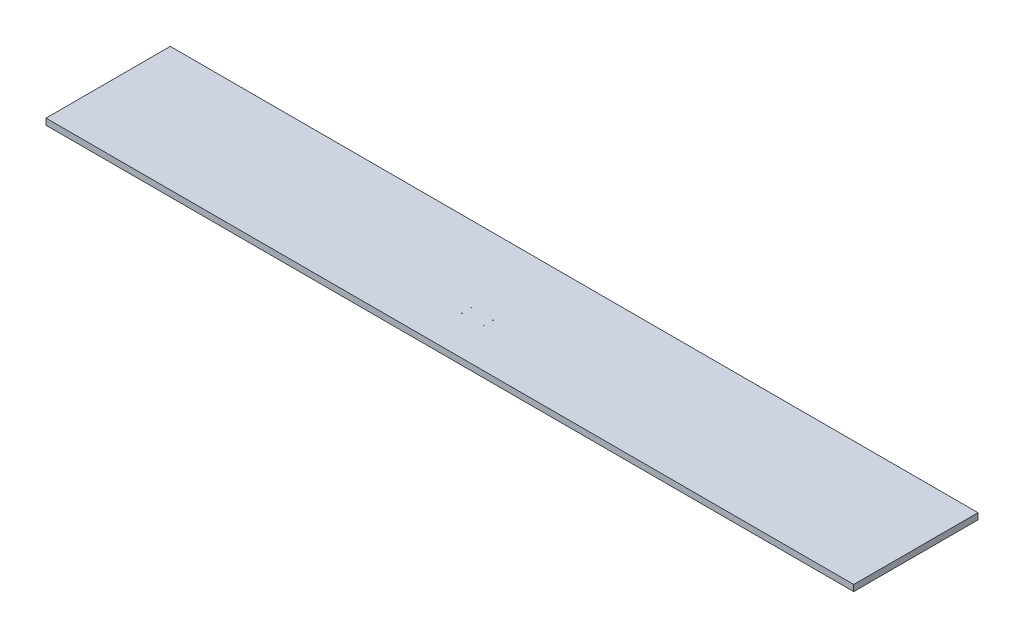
ISO-10303-21;
HEADER;
FILE_DESCRIPTION(('STEP AP214'),'2;1');
FILE_NAME('part.step','',(''),(''),'','','');
FILE_SCHEMA(('AUTOMOTIVE_DESIGN { 1 0 10303 214 1 1 1 1 }'));
ENDSEC;
DATA;
#1=APPLICATION_CONTEXT('core data for automotive mechanical design processes');
#2=APPLICATION_PROTOCOL_DEFINITION('international standard','automotive_design',2000,#1);
#3=PRODUCT_CONTEXT('',#1,'mechanical');
#4=PRODUCT('Part','Part','',(#3));
#5=PRODUCT_RELATED_PRODUCT_CATEGORY('part','',(#4));
#6=PRODUCT_DEFINITION_FORMATION('','',#4);
#7=PRODUCT_DEFINITION_CONTEXT('part definition',#1,'design');
#8=PRODUCT_DEFINITION('design','',#6,#7);
#9=PRODUCT_DEFINITION_SHAPE('','',#8);
#10=(LENGTH_UNIT() NAMED_UNIT(*) SI_UNIT(.MILLI.,.METRE.));
#11=(NAMED_UNIT(*) PLANE_ANGLE_UNIT() SI_UNIT($,.RADIAN.));
#12=(NAMED_UNIT(*) SI_UNIT($,.STERADIAN.) SOLID_ANGLE_UNIT());
#13=UNCERTAINTY_MEASURE_WITH_UNIT(LENGTH_MEASURE(1.E-05),#10,'distance_accuracy_value','');
#14=(GEOMETRIC_REPRESENTATION_CONTEXT(3) GLOBAL_UNCERTAINTY_ASSIGNED_CONTEXT((#13)) GLOBAL_UNIT_ASSIGNED_CONTEXT((#10,
#11,#12)) REPRESENTATION_CONTEXT('',''));
#15=CARTESIAN_POINT('',(0.,0.,0.));
#16=DIRECTION('',(0.,0.,1.));
#17=DIRECTION('',(1.,0.,0.));
#18=AXIS2_PLACEMENT_3D('',#15,#16,#17);
#19=CARTESIAN_POINT('',(6500.,-100.,-1000.));
#20=DIRECTION('',(1.,0.,0.));
#21=DIRECTION('',(0.,0.,-1.));
#22=AXIS2_PLACEMENT_3D('',#19,#20,#21);
#23=PLANE('',#22);
#24=DIRECTION('',(0.,0.,-1.));
#25=VECTOR('',#24,1.);
#26=CARTESIAN_POINT('',(6500.,0.,-1000.));
#27=LINE('',#26,#25);
#28=CARTESIAN_POINT('',(6500.,0.,1000.));
#29=VERTEX_POINT('',#28);
#30=CARTESIAN_POINT('',(6500.,0.,-1000.));
#31=VERTEX_POINT('',#30);
#32=EDGE_CURVE('E100',#29,#31,#27,.T.);
#33=ORIENTED_EDGE('',*,*,#32,.F.);
#34=DIRECTION('',(0.,1.,0.));
#35=VECTOR('',#34,1.);
#36=CARTESIAN_POINT('',(6500.,-100.,1000.));
#37=LINE('',#36,#35);
#38=CARTESIAN_POINT('',(6500.,-100.,1000.));
#39=VERTEX_POINT('',#38);
#40=EDGE_CURVE('E11',#39,#29,#37,.T.);
#41=ORIENTED_EDGE('',*,*,#40,.F.);
#42=DIRECTION('',(0.,0.,-1.));
#43=VECTOR('',#42,1.);
#44=CARTESIAN_POINT('',(6500.,-100.,-1000.));
#45=LINE('',#44,#43);
#46=CARTESIAN_POINT('',(6500.,-100.,-1000.));
#47=VERTEX_POINT('',#46);
#48=EDGE_CURVE('E93',#39,#47,#45,.T.);
#49=ORIENTED_EDGE('',*,*,#48,.T.);
#50=DIRECTION('',(0.,1.,0.));
#51=VECTOR('',#50,1.);
#52=CARTESIAN_POINT('',(6500.,-100.,-1000.));
#53=LINE('',#52,#51);
#54=EDGE_CURVE('E38',#47,#31,#53,.T.);
#55=ORIENTED_EDGE('',*,*,#54,.T.);
#56=EDGE_LOOP('',(#33,#41,#49,#55));
#57=FACE_BOUND('',#56,.T.);
#58=ADVANCED_FACE('F35',(#57),#23,.T.);
#59=CARTESIAN_POINT('',(-6500.,-100.,1000.));
#60=DIRECTION('',(0.,0.,1.));
#61=DIRECTION('',(1.,0.,0.));
#62=AXIS2_PLACEMENT_3D('',#59,#60,#61);
#63=PLANE('',#62);
#64=DIRECTION('',(1.,0.,0.));
#65=VECTOR('',#64,1.);
#66=CARTESIAN_POINT('',(-6500.,0.,1000.));
#67=LINE('',#66,#65);
#68=CARTESIAN_POINT('',(-6500.,0.,1000.));
#69=VERTEX_POINT('',#68);
#70=EDGE_CURVE('E95',#69,#29,#67,.T.);
#71=ORIENTED_EDGE('',*,*,#70,.F.);
#72=DIRECTION('',(0.,1.,0.));
#73=VECTOR('',#72,1.);
#74=CARTESIAN_POINT('',(-6500.,-100.,1000.));
#75=LINE('',#74,#73);
#76=CARTESIAN_POINT('',(-6500.,-100.,1000.));
#77=VERTEX_POINT('',#76);
#78=EDGE_CURVE('E44',#77,#69,#75,.T.);
#79=ORIENTED_EDGE('',*,*,#78,.F.);
#80=DIRECTION('',(1.,0.,0.));
#81=VECTOR('',#80,1.);
#82=CARTESIAN_POINT('',(-6500.,-100.,1000.));
#83=LINE('',#82,#81);
#84=EDGE_CURVE('E90',#77,#39,#83,.T.);
#85=ORIENTED_EDGE('',*,*,#84,.T.);
#86=ORIENTED_EDGE('',*,*,#40,.T.);
#87=EDGE_LOOP('',(#71,#79,#85,#86));
#88=FACE_BOUND('',#87,.T.);
#89=ADVANCED_FACE('F111',(#88),#63,.T.);
#90=CARTESIAN_POINT('',(-6500.,-100.,-1000.));
#91=DIRECTION('',(-1.,0.,0.));
#92=DIRECTION('',(0.,0.,1.));
#93=AXIS2_PLACEMENT_3D('',#90,#91,#92);
#94=PLANE('',#93);
#95=DIRECTION('',(0.,0.,1.));
#96=VECTOR('',#95,1.);
#97=CARTESIAN_POINT('',(-6500.,0.,-1000.));
#98=LINE('',#97,#96);
#99=CARTESIAN_POINT('',(-6500.,0.,-1000.));
#100=VERTEX_POINT('',#99);
#101=EDGE_CURVE('E85',#100,#69,#98,.T.);
#102=ORIENTED_EDGE('',*,*,#101,.F.);
#103=DIRECTION('',(0.,1.,0.));
#104=VECTOR('',#103,1.);
#105=CARTESIAN_POINT('',(-6500.,-100.,-1000.));
#106=LINE('',#105,#104);
#107=CARTESIAN_POINT('',(-6500.,-100.,-1000.));
#108=VERTEX_POINT('',#107);
#109=EDGE_CURVE('E80',#108,#100,#106,.T.);
#110=ORIENTED_EDGE('',*,*,#109,.F.);
#111=DIRECTION('',(0.,0.,1.));
#112=VECTOR('',#111,1.);
#113=CARTESIAN_POINT('',(-6500.,-100.,-1000.));
#114=LINE('',#113,#112);
#115=EDGE_CURVE('E83',#108,#77,#114,.T.);
#116=ORIENTED_EDGE('',*,*,#115,.T.);
#117=ORIENTED_EDGE('',*,*,#78,.T.);
#118=EDGE_LOOP('',(#102,#110,#116,#117));
#119=FACE_BOUND('',#118,.T.);
#120=ADVANCED_FACE('F82',(#119),#94,.T.);
#121=CARTESIAN_POINT('',(-6500.,-100.,-1000.));
#122=DIRECTION('',(0.,0.,-1.));
#123=DIRECTION('',(-1.,0.,0.));
#124=AXIS2_PLACEMENT_3D('',#121,#122,#123);
#125=PLANE('',#124);
#126=DIRECTION('',(-1.,0.,0.));
#127=VECTOR('',#126,1.);
#128=CARTESIAN_POINT('',(-6500.,0.,-1000.));
#129=LINE('',#128,#127);
#130=EDGE_CURVE('E103',#31,#100,#129,.T.);
#131=ORIENTED_EDGE('',*,*,#130,.F.);
#132=ORIENTED_EDGE('',*,*,#54,.F.);
#133=DIRECTION('',(-1.,0.,0.));
#134=VECTOR('',#133,1.);
#135=CARTESIAN_POINT('',(-6500.,-100.,-1000.));
#136=LINE('',#135,#134);
#137=EDGE_CURVE('E89',#47,#108,#136,.T.);
#138=ORIENTED_EDGE('',*,*,#137,.T.);
#139=ORIENTED_EDGE('',*,*,#109,.T.);
#140=EDGE_LOOP('',(#131,#132,#138,#139));
#141=FACE_BOUND('',#140,.T.);
#142=ADVANCED_FACE('F92',(#141),#125,.T.);
#143=CARTESIAN_POINT('',(0.,-100.,0.));
#144=DIRECTION('',(0.,1.,0.));
#145=DIRECTION('',(0.,0.,1.));
#146=AXIS2_PLACEMENT_3D('',#143,#144,#145);
#147=PLANE('',#146);
#148=CARTESIAN_POINT('',(-85.0000000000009,-100.,370.));
#149=DIRECTION('',(0.,1.,0.));
#150=DIRECTION('',(0.,0.,1.));
#151=AXIS2_PLACEMENT_3D('',#148,#149,#150);
#152=CIRCLE('',#151,5.00000000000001);
#153=CARTESIAN_POINT('',(-85.0000000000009,-100.,375.));
#154=VERTEX_POINT('',#153);
#155=EDGE_CURVE('E162',#154,#154,#152,.T.);
#156=ORIENTED_EDGE('',*,*,#155,.T.);
#157=EDGE_LOOP('',(#156));
#158=FACE_BOUND('',#157,.T.);
#159=CARTESIAN_POINT('',(-435.000000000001,-100.,220.));
#160=DIRECTION('',(0.,1.,0.));
#161=DIRECTION('',(0.,0.,1.));
#162=AXIS2_PLACEMENT_3D('',#159,#160,#161);
#163=CIRCLE('',#162,4.99999999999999);
#164=CARTESIAN_POINT('',(-435.000000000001,-100.,225.));
#165=VERTEX_POINT('',#164);
#166=EDGE_CURVE('E168',#165,#165,#163,.T.);
#167=ORIENTED_EDGE('',*,*,#166,.T.);
#168=EDGE_LOOP('',(#167));
#169=FACE_BOUND('',#168,.T.);
#170=CARTESIAN_POINT('',(-435.000000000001,-100.,370.));
#171=DIRECTION('',(0.,1.,0.));
#172=DIRECTION('',(0.,0.,1.));
#173=AXIS2_PLACEMENT_3D('',#170,#171,#172);
#174=CIRCLE('',#173,4.99999999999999);
#175=CARTESIAN_POINT('',(-435.000000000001,-100.,375.));
#176=VERTEX_POINT('',#175);
#177=EDGE_CURVE('E153',#176,#176,#174,.T.);
#178=ORIENTED_EDGE('',*,*,#177,.T.);
#179=EDGE_LOOP('',(#178));
#180=FACE_BOUND('',#179,.T.);
#181=CARTESIAN_POINT('',(-85.0000000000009,-100.,220.));
#182=DIRECTION('',(0.,1.,0.));
#183=DIRECTION('',(0.,0.,1.));
#184=AXIS2_PLACEMENT_3D('',#181,#182,#183);
#185=CIRCLE('',#184,5.00000000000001);
#186=CARTESIAN_POINT('',(-85.0000000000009,-100.,225.));
#187=VERTEX_POINT('',#186);
#188=EDGE_CURVE('E104',#187,#187,#185,.T.);
#189=ORIENTED_EDGE('',*,*,#188,.T.);
#190=EDGE_LOOP('',(#189));
#191=FACE_BOUND('',#190,.T.);
#192=ORIENTED_EDGE('',*,*,#48,.F.);
#193=ORIENTED_EDGE('',*,*,#84,.F.);
#194=ORIENTED_EDGE('',*,*,#115,.F.);
#195=ORIENTED_EDGE('',*,*,#137,.F.);
#196=EDGE_LOOP('',(#192,#193,#194,#195));
#197=FACE_BOUND('',#196,.T.);
#198=ADVANCED_FACE('F88',(#158,#169,#180,#191,#197),#147,.F.);
#199=CARTESIAN_POINT('',(0.,0.,0.));
#200=DIRECTION('',(0.,1.,0.));
#201=DIRECTION('',(0.,0.,1.));
#202=AXIS2_PLACEMENT_3D('',#199,#200,#201);
#203=PLANE('',#202);
#204=CARTESIAN_POINT('',(-85.0000000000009,0.,370.));
#205=DIRECTION('',(0.,1.,0.));
#206=DIRECTION('',(0.,0.,1.));
#207=AXIS2_PLACEMENT_3D('',#204,#205,#206);
#208=CIRCLE('',#207,5.00000000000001);
#209=CARTESIAN_POINT('',(-85.0000000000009,0.,375.));
#210=VERTEX_POINT('',#209);
#211=EDGE_CURVE('E165',#210,#210,#208,.T.);
#212=ORIENTED_EDGE('',*,*,#211,.F.);
#213=EDGE_LOOP('',(#212));
#214=FACE_BOUND('',#213,.T.);
#215=CARTESIAN_POINT('',(-435.000000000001,0.,220.));
#216=DIRECTION('',(0.,1.,0.));
#217=DIRECTION('',(0.,0.,1.));
#218=AXIS2_PLACEMENT_3D('',#215,#216,#217);
#219=CIRCLE('',#218,4.99999999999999);
#220=CARTESIAN_POINT('',(-435.000000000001,0.,225.));
#221=VERTEX_POINT('',#220);
#222=EDGE_CURVE('E159',#221,#221,#219,.T.);
#223=ORIENTED_EDGE('',*,*,#222,.F.);
#224=EDGE_LOOP('',(#223));
#225=FACE_BOUND('',#224,.T.);
#226=CARTESIAN_POINT('',(-435.000000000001,0.,370.));
#227=DIRECTION('',(0.,1.,0.));
#228=DIRECTION('',(0.,0.,1.));
#229=AXIS2_PLACEMENT_3D('',#226,#227,#228);
#230=CIRCLE('',#229,4.99999999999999);
#231=CARTESIAN_POINT('',(-435.000000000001,0.,375.));
#232=VERTEX_POINT('',#231);
#233=EDGE_CURVE('E156',#232,#232,#230,.T.);
#234=ORIENTED_EDGE('',*,*,#233,.F.);
#235=EDGE_LOOP('',(#234));
#236=FACE_BOUND('',#235,.T.);
#237=CARTESIAN_POINT('',(-85.0000000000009,0.,220.));
#238=DIRECTION('',(0.,1.,0.));
#239=DIRECTION('',(0.,0.,1.));
#240=AXIS2_PLACEMENT_3D('',#237,#238,#239);
#241=CIRCLE('',#240,5.00000000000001);
#242=CARTESIAN_POINT('',(-85.0000000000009,0.,225.));
#243=VERTEX_POINT('',#242);
#244=EDGE_CURVE('E164',#243,#243,#241,.T.);
#245=ORIENTED_EDGE('',*,*,#244,.F.);
#246=EDGE_LOOP('',(#245));
#247=FACE_BOUND('',#246,.T.);
#248=ORIENTED_EDGE('',*,*,#32,.T.);
#249=ORIENTED_EDGE('',*,*,#130,.T.);
#250=ORIENTED_EDGE('',*,*,#101,.T.);
#251=ORIENTED_EDGE('',*,*,#70,.T.);
#252=EDGE_LOOP('',(#248,#249,#250,#251));
#253=FACE_BOUND('',#252,.T.);
#254=ADVANCED_FACE('F110',(#214,#225,#236,#247,#253),#203,.T.);
#255=CARTESIAN_POINT('',(-85.0000000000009,-100.,220.));
#256=DIRECTION('',(0.,1.,0.));
#257=DIRECTION('',(0.,0.,1.));
#258=AXIS2_PLACEMENT_3D('',#255,#256,#257);
#259=CYLINDRICAL_SURFACE('',#258,5.00000000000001);
#260=ORIENTED_EDGE('',*,*,#188,.F.);
#261=EDGE_LOOP('',(#260));
#262=FACE_BOUND('',#261,.T.);
#263=ORIENTED_EDGE('',*,*,#244,.T.);
#264=EDGE_LOOP('',(#263));
#265=FACE_BOUND('',#264,.T.);
#266=ADVANCED_FACE('F129',(#262,#265),#259,.F.);
#267=CARTESIAN_POINT('',(-435.000000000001,-100.,370.));
#268=DIRECTION('',(0.,1.,0.));
#269=DIRECTION('',(0.,0.,1.));
#270=AXIS2_PLACEMENT_3D('',#267,#268,#269);
#271=CYLINDRICAL_SURFACE('',#270,4.99999999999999);
#272=ORIENTED_EDGE('',*,*,#177,.F.);
#273=EDGE_LOOP('',(#272));
#274=FACE_BOUND('',#273,.T.);
#275=ORIENTED_EDGE('',*,*,#233,.T.);
#276=EDGE_LOOP('',(#275));
#277=FACE_BOUND('',#276,.T.);
#278=ADVANCED_FACE('F136',(#274,#277),#271,.F.);
#279=CARTESIAN_POINT('',(-435.000000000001,-100.,220.));
#280=DIRECTION('',(0.,1.,0.));
#281=DIRECTION('',(0.,0.,1.));
#282=AXIS2_PLACEMENT_3D('',#279,#280,#281);
#283=CYLINDRICAL_SURFACE('',#282,4.99999999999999);
#284=ORIENTED_EDGE('',*,*,#166,.F.);
#285=EDGE_LOOP('',(#284));
#286=FACE_BOUND('',#285,.T.);
#287=ORIENTED_EDGE('',*,*,#222,.T.);
#288=EDGE_LOOP('',(#287));
#289=FACE_BOUND('',#288,.T.);
#290=ADVANCED_FACE('F138',(#286,#289),#283,.F.);
#291=CARTESIAN_POINT('',(-85.0000000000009,-100.,370.));
#292=DIRECTION('',(0.,1.,0.));
#293=DIRECTION('',(0.,0.,1.));
#294=AXIS2_PLACEMENT_3D('',#291,#292,#293);
#295=CYLINDRICAL_SURFACE('',#294,5.00000000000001);
#296=ORIENTED_EDGE('',*,*,#155,.F.);
#297=EDGE_LOOP('',(#296));
#298=FACE_BOUND('',#297,.T.);
#299=ORIENTED_EDGE('',*,*,#211,.T.);
#300=EDGE_LOOP('',(#299));
#301=FACE_BOUND('',#300,.T.);
#302=ADVANCED_FACE('F141',(#298,#301),#295,.F.);
#303=CLOSED_SHELL('',(#58,#89,#120,#142,#198,#254,#266,#278,#290,#302));
#304=MANIFOLD_SOLID_BREP('B2',#303);
#305=ADVANCED_BREP_SHAPE_REPRESENTATION('',(#18,#304),#14);
#306=SHAPE_DEFINITION_REPRESENTATION(#9,#305);
ENDSEC;
END-ISO-10303-21;
